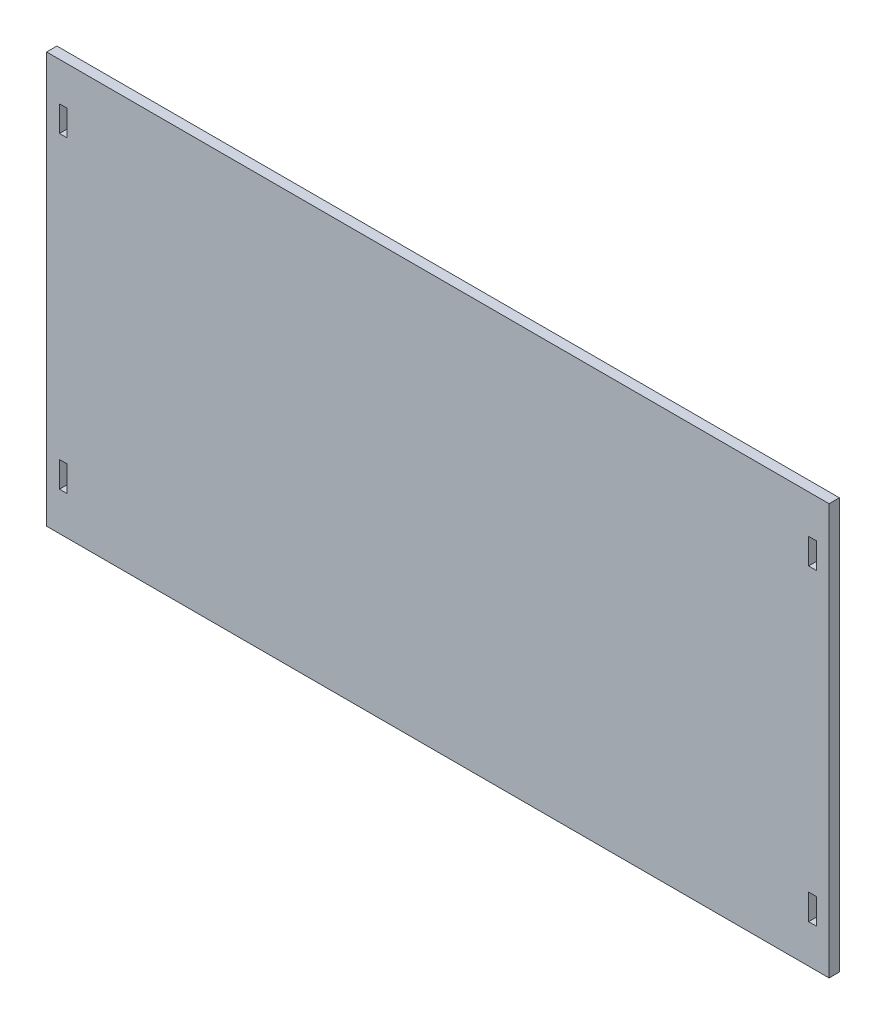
from build123d import *

# Parameters (mm, degrees)
BOSS_EXTRUDE1_DEPTH = 4
SKETCH2_W           = 3
SKETCH2_H           = 10
CUT_EXTRUDE1_DEPTH  = 4


with BuildPart() as part:
    # Sketch1 → Boss-Extrude1 (new body)
    with BuildSketch(Plane.XY):
        Polygon((-63.840152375, 21.104182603), (-63.840152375, 31.104182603), (240.959847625, 31.104182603), (240.959847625, 21.104182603), (240.959847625, -128.895817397), (-63.840152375, -128.895817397), align=None)
    extrude(amount=BOSS_EXTRUDE1_DEPTH)

    # Sketch2 → Cut-Extrude1 (cut)
    with BuildSketch(Plane.XY):
        with Locations((-57.340152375, 11.104182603)):
            Rectangle(SKETCH2_W, SKETCH2_H)
        with Locations((-57.340152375, -108.895817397)):
            Rectangle(SKETCH2_W, SKETCH2_H)
        with Locations((234.459847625, -108.895817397)):
            Rectangle(SKETCH2_W, SKETCH2_H)
        with Locations((234.459847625, 11.104182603)):
            Rectangle(SKETCH2_W, SKETCH2_H)
    extrude(amount=CUT_EXTRUDE1_DEPTH, mode=Mode.SUBTRACT)


solid = part.part
